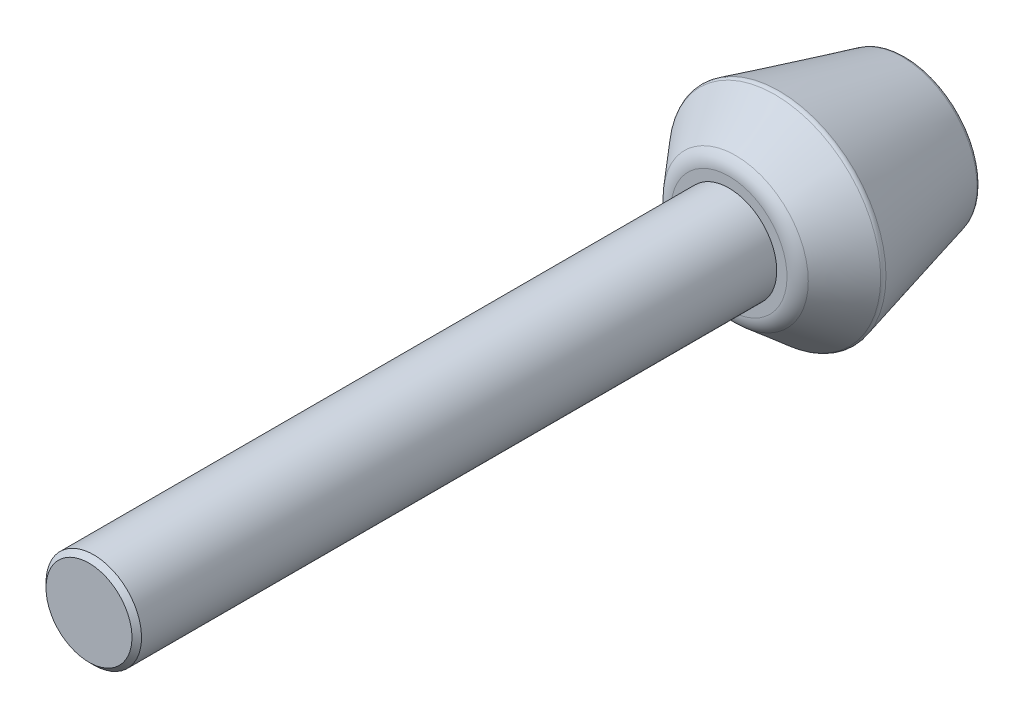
ISO-10303-21;
HEADER;
FILE_DESCRIPTION(('STEP AP214'),'2;1');
FILE_NAME('part.step','',(''),(''),'','','');
FILE_SCHEMA(('AUTOMOTIVE_DESIGN { 1 0 10303 214 1 1 1 1 }'));
ENDSEC;
DATA;
#1=APPLICATION_CONTEXT('core data for automotive mechanical design processes');
#2=APPLICATION_PROTOCOL_DEFINITION('international standard','automotive_design',2000,#1);
#3=PRODUCT_CONTEXT('',#1,'mechanical');
#4=PRODUCT('Part','Part','',(#3));
#5=PRODUCT_RELATED_PRODUCT_CATEGORY('part','',(#4));
#6=PRODUCT_DEFINITION_FORMATION('','',#4);
#7=PRODUCT_DEFINITION_CONTEXT('part definition',#1,'design');
#8=PRODUCT_DEFINITION('design','',#6,#7);
#9=PRODUCT_DEFINITION_SHAPE('','',#8);
#10=(LENGTH_UNIT() NAMED_UNIT(*) SI_UNIT(.MILLI.,.METRE.));
#11=(NAMED_UNIT(*) PLANE_ANGLE_UNIT() SI_UNIT($,.RADIAN.));
#12=(NAMED_UNIT(*) SI_UNIT($,.STERADIAN.) SOLID_ANGLE_UNIT());
#13=UNCERTAINTY_MEASURE_WITH_UNIT(LENGTH_MEASURE(1.E-05),#10,'distance_accuracy_value','');
#14=(GEOMETRIC_REPRESENTATION_CONTEXT(3) GLOBAL_UNCERTAINTY_ASSIGNED_CONTEXT((#13)) GLOBAL_UNIT_ASSIGNED_CONTEXT((#10,
#11,#12)) REPRESENTATION_CONTEXT('',''));
#15=CARTESIAN_POINT('',(0.,0.,0.));
#16=DIRECTION('',(0.,0.,1.));
#17=DIRECTION('',(1.,0.,0.));
#18=AXIS2_PLACEMENT_3D('',#15,#16,#17);
#19=CARTESIAN_POINT('',(0.,0.,0.));
#20=DIRECTION('',(0.,0.,-1.));
#21=DIRECTION('',(0.,1.,0.));
#22=AXIS2_PLACEMENT_3D('',#19,#20,#21);
#23=PLANE('',#22);
#24=CARTESIAN_POINT('',(0.,0.,0.));
#25=DIRECTION('',(0.,0.,-1.));
#26=DIRECTION('',(0.,1.,0.));
#27=AXIS2_PLACEMENT_3D('',#24,#25,#26);
#28=CIRCLE('',#27,7.36309904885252);
#29=CARTESIAN_POINT('',(0.,7.36309904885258,0.));
#30=VERTEX_POINT('',#29);
#31=EDGE_CURVE('E19',#30,#30,#28,.F.);
#32=ORIENTED_EDGE('',*,*,#31,.F.);
#33=EDGE_LOOP('',(#32));
#34=FACE_BOUND('',#33,.T.);
#35=ADVANCED_FACE('F15',(#34),#23,.T.);
#36=CARTESIAN_POINT('',(0.,0.,0.5));
#37=DIRECTION('',(0.,0.,-1.));
#38=DIRECTION('',(0.,1.,0.));
#39=AXIS2_PLACEMENT_3D('',#36,#37,#38);
#40=TOROIDAL_SURFACE('',#39,7.36309904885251,0.5);
#41=CARTESIAN_POINT('',(0.,0.,0.374518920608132));
#42=DIRECTION('',(0.,0.,1.));
#43=DIRECTION('',(1.,0.,0.));
#44=AXIS2_PLACEMENT_3D('',#41,#42,#43);
#45=CIRCLE('',#44,7.84709749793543);
#46=CARTESIAN_POINT('',(7.84709749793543,0.,0.37451892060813));
#47=VERTEX_POINT('',#46);
#48=EDGE_CURVE('E41',#47,#47,#45,.T.);
#49=ORIENTED_EDGE('',*,*,#48,.F.);
#50=EDGE_LOOP('',(#49));
#51=FACE_BOUND('',#50,.T.);
#52=ORIENTED_EDGE('',*,*,#31,.T.);
#53=EDGE_LOOP('',(#52));
#54=FACE_BOUND('',#53,.T.);
#55=ADVANCED_FACE('F80',(#51,#54),#40,.T.);
#56=CARTESIAN_POINT('',(0.,0.,13.2485883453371));
#57=DIRECTION('',(0.,0.,1.));
#58=DIRECTION('',(1.,0.,0.));
#59=AXIS2_PLACEMENT_3D('',#56,#57,#58);
#60=CONICAL_SURFACE('',#59,11.1848192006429,0.253674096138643);
#61=CARTESIAN_POINT('',(0.,0.,13.2485883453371));
#62=DIRECTION('',(0.,0.,1.));
#63=DIRECTION('',(0.,-1.,0.));
#64=AXIS2_PLACEMENT_3D('',#61,#62,#63);
#65=CIRCLE('',#64,11.1848192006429);
#66=CARTESIAN_POINT('',(0.,-11.1848192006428,13.2485883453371));
#67=VERTEX_POINT('',#66);
#68=EDGE_CURVE('E38',#67,#67,#65,.T.);
#69=ORIENTED_EDGE('',*,*,#68,.F.);
#70=EDGE_LOOP('',(#69));
#71=FACE_BOUND('',#70,.T.);
#72=ORIENTED_EDGE('',*,*,#48,.T.);
#73=EDGE_LOOP('',(#72));
#74=FACE_BOUND('',#73,.T.);
#75=ADVANCED_FACE('F77',(#71,#74),#60,.T.);
#76=CARTESIAN_POINT('',(0.,0.,13.3740694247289));
#77=DIRECTION('',(0.,0.,-1.));
#78=DIRECTION('',(0.,1.,0.));
#79=AXIS2_PLACEMENT_3D('',#76,#77,#78);
#80=TOROIDAL_SURFACE('',#79,10.70082075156,0.500000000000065);
#81=ORIENTED_EDGE('',*,*,#68,.T.);
#82=EDGE_LOOP('',(#81));
#83=FACE_BOUND('',#82,.T.);
#84=CARTESIAN_POINT('',(0.,0.,13.6978936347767));
#85=DIRECTION('',(0.,0.,-1.));
#86=DIRECTION('',(-1.,0.,0.));
#87=AXIS2_PLACEMENT_3D('',#84,#85,#86);
#88=CIRCLE('',#87,11.0817904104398);
#89=CARTESIAN_POINT('',(-11.0817904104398,0.,13.6978936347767));
#90=VERTEX_POINT('',#89);
#91=EDGE_CURVE('E35',#90,#90,#88,.F.);
#92=ORIENTED_EDGE('',*,*,#91,.F.);
#93=EDGE_LOOP('',(#92));
#94=FACE_BOUND('',#93,.T.);
#95=ADVANCED_FACE('F75',(#83,#94),#80,.T.);
#96=CARTESIAN_POINT('',(0.,0.,13.6978936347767));
#97=DIRECTION('',(0.,0.,-1.));
#98=DIRECTION('',(0.,1.,0.));
#99=AXIS2_PLACEMENT_3D('',#96,#97,#98);
#100=CONICAL_SURFACE('',#99,11.0817904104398,0.704494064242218);
#101=ORIENTED_EDGE('',*,*,#91,.T.);
#102=EDGE_LOOP('',(#101));
#103=FACE_BOUND('',#102,.T.);
#104=CARTESIAN_POINT('',(0.,0.,17.7952968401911));
#105=DIRECTION('',(0.,0.,1.));
#106=DIRECTION('',(0.,-1.,0.));
#107=AXIS2_PLACEMENT_3D('',#104,#105,#106);
#108=CIRCLE('',#107,7.59899768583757);
#109=CARTESIAN_POINT('',(0.,-7.59899768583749,17.7952968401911));
#110=VERTEX_POINT('',#109);
#111=EDGE_CURVE('E31',#110,#110,#108,.T.);
#112=ORIENTED_EDGE('',*,*,#111,.F.);
#113=EDGE_LOOP('',(#112));
#114=FACE_BOUND('',#113,.T.);
#115=ADVANCED_FACE('F72',(#103,#114),#100,.T.);
#116=CARTESIAN_POINT('',(0.,0.,16.5));
#117=DIRECTION('',(0.,0.,-1.));
#118=DIRECTION('',(0.,1.,0.));
#119=AXIS2_PLACEMENT_3D('',#116,#117,#118);
#120=TOROIDAL_SURFACE('',#119,6.07511905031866,2.00000000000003);
#121=CARTESIAN_POINT('',(0.,0.,18.5));
#122=DIRECTION('',(0.,0.,-1.));
#123=DIRECTION('',(0.,1.,0.));
#124=AXIS2_PLACEMENT_3D('',#121,#122,#123);
#125=CIRCLE('',#124,6.07511905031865);
#126=CARTESIAN_POINT('',(0.,6.07511905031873,18.5));
#127=VERTEX_POINT('',#126);
#128=EDGE_CURVE('E34',#127,#127,#125,.T.);
#129=ORIENTED_EDGE('',*,*,#128,.T.);
#130=EDGE_LOOP('',(#129));
#131=FACE_BOUND('',#130,.T.);
#132=ORIENTED_EDGE('',*,*,#111,.T.);
#133=EDGE_LOOP('',(#132));
#134=FACE_BOUND('',#133,.T.);
#135=ADVANCED_FACE('F17',(#131,#134),#120,.T.);
#136=CARTESIAN_POINT('',(0.,0.,85.5));
#137=DIRECTION('',(0.,0.,-1.));
#138=DIRECTION('',(0.,1.,0.));
#139=AXIS2_PLACEMENT_3D('',#136,#137,#138);
#140=PLANE('',#139);
#141=CARTESIAN_POINT('',(0.,0.,85.4999999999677));
#142=DIRECTION('',(0.,0.,-1.));
#143=DIRECTION('',(-1.,0.,0.));
#144=AXIS2_PLACEMENT_3D('',#141,#142,#143);
#145=CIRCLE('',#144,4.50000000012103);
#146=CARTESIAN_POINT('',(-4.50000000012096,0.,85.4999999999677));
#147=VERTEX_POINT('',#146);
#148=EDGE_CURVE('E28',#147,#147,#145,.T.);
#149=ORIENTED_EDGE('',*,*,#148,.F.);
#150=EDGE_LOOP('',(#149));
#151=FACE_BOUND('',#150,.T.);
#152=ADVANCED_FACE('F54',(#151),#140,.F.);
#153=CARTESIAN_POINT('',(0.,0.,18.5));
#154=DIRECTION('',(0.,0.,-1.));
#155=DIRECTION('',(0.,1.,0.));
#156=AXIS2_PLACEMENT_3D('',#153,#154,#155);
#157=PLANE('',#156);
#158=ORIENTED_EDGE('',*,*,#128,.F.);
#159=EDGE_LOOP('',(#158));
#160=FACE_BOUND('',#159,.T.);
#161=CARTESIAN_POINT('',(0.,0.,18.5));
#162=DIRECTION('',(0.,0.,1.));
#163=DIRECTION('',(0.,-1.,0.));
#164=AXIS2_PLACEMENT_3D('',#161,#162,#163);
#165=CIRCLE('',#164,5.);
#166=CARTESIAN_POINT('',(0.,-5.00000000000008,18.5));
#167=VERTEX_POINT('',#166);
#168=EDGE_CURVE('E23',#167,#167,#165,.T.);
#169=ORIENTED_EDGE('',*,*,#168,.F.);
#170=EDGE_LOOP('',(#169));
#171=FACE_BOUND('',#170,.T.);
#172=ADVANCED_FACE('F50',(#160,#171),#157,.F.);
#173=CARTESIAN_POINT('',(0.,0.,84.9999999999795));
#174=DIRECTION('',(0.,0.,-1.));
#175=DIRECTION('',(-1.,0.,0.));
#176=AXIS2_PLACEMENT_3D('',#173,#174,#175);
#177=CONICAL_SURFACE('',#176,4.99999999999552,0.785398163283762);
#178=CARTESIAN_POINT('',(0.,0.,85.));
#179=DIRECTION('',(0.,0.,1.));
#180=DIRECTION('',(0.,-1.,0.));
#181=AXIS2_PLACEMENT_3D('',#178,#179,#180);
#182=CIRCLE('',#181,5.);
#183=CARTESIAN_POINT('',(0.,-5.00000000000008,85.));
#184=VERTEX_POINT('',#183);
#185=EDGE_CURVE('E10',#184,#184,#182,.F.);
#186=ORIENTED_EDGE('',*,*,#185,.F.);
#187=EDGE_LOOP('',(#186));
#188=FACE_BOUND('',#187,.T.);
#189=ORIENTED_EDGE('',*,*,#148,.T.);
#190=EDGE_LOOP('',(#189));
#191=FACE_BOUND('',#190,.T.);
#192=ADVANCED_FACE('F53',(#188,#191),#177,.T.);
#193=CARTESIAN_POINT('',(0.,0.,4.5));
#194=DIRECTION('',(0.,0.,1.));
#195=DIRECTION('',(0.,-1.,0.));
#196=AXIS2_PLACEMENT_3D('',#193,#194,#195);
#197=CYLINDRICAL_SURFACE('',#196,5.);
#198=ORIENTED_EDGE('',*,*,#168,.T.);
#199=EDGE_LOOP('',(#198));
#200=FACE_BOUND('',#199,.T.);
#201=ORIENTED_EDGE('',*,*,#185,.T.);
#202=EDGE_LOOP('',(#201));
#203=FACE_BOUND('',#202,.T.);
#204=ADVANCED_FACE('F58',(#200,#203),#197,.T.);
#205=CLOSED_SHELL('',(#35,#55,#75,#95,#115,#135,#152,#172,#192,#204));
#206=MANIFOLD_SOLID_BREP('B1',#205);
#207=ADVANCED_BREP_SHAPE_REPRESENTATION('',(#18,#206),#14);
#208=SHAPE_DEFINITION_REPRESENTATION(#9,#207);
ENDSEC;
END-ISO-10303-21;
